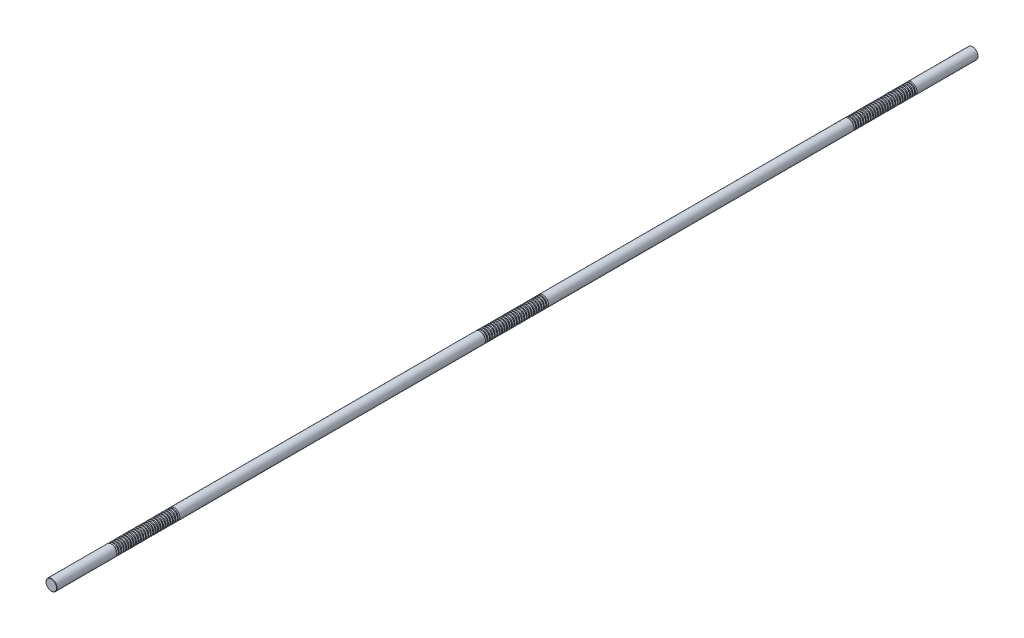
from build123d import *

# Parameters (mm, degrees)
SKETCH1_R           = 9
BOSS_EXTRUDE1_DEPTH = 750
CHAMFER1_SIZE       = 0.45
LPATTERN1_COUNT     = 26
LPATTERN1_PITCH     = 4
LPATTERN2_COUNT     = 3
LPATTERN2_PITCH     = 600


with BuildPart() as part:
    # Sketch1 → Boss-Extrude1 (new, symmetric)
    with BuildSketch(Plane.XY):
        Circle(SKETCH1_R)
    extrude(amount=BOSS_EXTRUDE1_DEPTH, both=True)

    # Chamfer1
    chamfer1_edges = [part.edges().sort_by_distance(p)[0] for p in [
        (-9, 0, -750),
        (-9, 0, 750),
    ]]
    chamfer(chamfer1_edges, length=CHAMFER1_SIZE)

    # Sketch2 → Cut-Revolve1 (revolve, cut)
    with BuildSketch(Plane(origin=(0, 0, 0), x_dir=(0, 0, -1), z_dir=(1, 0, 0)), mode=Mode.PRIVATE) as cut_revolve1_sk:
        Polygon((650.301442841, 9), (647.698557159, 9), (648.301442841, 6.75), (649.698557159, 6.75), align=None)
    cut_revolve1 = revolve(cut_revolve1_sk.sketch.rotate(Axis((0, 0, 750), (0, 0, -1)), 90), axis=Axis((0, 0, 750), (0, 0, -1)), mode=Mode.SUBTRACT)

    # LPattern1: Cut-Revolve1 ×26
    with Locations(*[(0, 0, i * LPATTERN1_PITCH) for i in range(1, LPATTERN1_COUNT)]):
        add(cut_revolve1, mode=Mode.SUBTRACT)

    # LPattern2: Cut-Revolve1 ×3
    with Locations(*[(0, 0, i * LPATTERN2_PITCH) for i in range(1, LPATTERN2_COUNT)]):
        add(cut_revolve1, mode=Mode.SUBTRACT)

    # LPattern2 copy 1 sketch → LPattern2 copy 1 (revolve, cut)
    with BuildSketch(Plane(origin=(0, 0, 604), x_dir=(0, 0, -1), z_dir=(1, 0, 0))):
        Polygon((650.301442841, 9), (647.698557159, 9), (648.301442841, 6.75), (649.698557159, 6.75), align=None)
    revolve(axis=Axis((0, 0, 1354), (0, 0, -1)), mode=Mode.SUBTRACT)

    # LPattern2 copy 2 sketch → LPattern2 copy 2 (revolve, cut)
    with BuildSketch(Plane(origin=(0, 0, 1204), x_dir=(0, 0, -1), z_dir=(1, 0, 0))):
        Polygon((650.301442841, 9), (647.698557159, 9), (648.301442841, 6.75), (649.698557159, 6.75), align=None)
    revolve(axis=Axis((0, 0, 1954), (0, 0, -1)), mode=Mode.SUBTRACT)

    # LPattern2 copy 3 sketch → LPattern2 copy 3 (revolve, cut)
    with BuildSketch(Plane(origin=(0, 0, 608), x_dir=(0, 0, -1), z_dir=(1, 0, 0))):
        Polygon((650.301442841, 9), (647.698557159, 9), (648.301442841, 6.75), (649.698557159, 6.75), align=None)
    revolve(axis=Axis((0, 0, 1358), (0, 0, -1)), mode=Mode.SUBTRACT)

    # LPattern2 copy 4 sketch → LPattern2 copy 4 (revolve, cut)
    with BuildSketch(Plane(origin=(0, 0, 1208), x_dir=(0, 0, -1), z_dir=(1, 0, 0))):
        Polygon((650.301442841, 9), (647.698557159, 9), (648.301442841, 6.75), (649.698557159, 6.75), align=None)
    revolve(axis=Axis((0, 0, 1958), (0, 0, -1)), mode=Mode.SUBTRACT)

    # LPattern2 copy 5 sketch → LPattern2 copy 5 (revolve, cut)
    with BuildSketch(Plane(origin=(0, 0, 612), x_dir=(0, 0, -1), z_dir=(1, 0, 0))):
        Polygon((650.301442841, 9), (647.698557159, 9), (648.301442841, 6.75), (649.698557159, 6.75), align=None)
    revolve(axis=Axis((0, 0, 1362), (0, 0, -1)), mode=Mode.SUBTRACT)

    # LPattern2 copy 6 sketch → LPattern2 copy 6 (revolve, cut)
    with BuildSketch(Plane(origin=(0, 0, 1212), x_dir=(0, 0, -1), z_dir=(1, 0, 0))):
        Polygon((650.301442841, 9), (647.698557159, 9), (648.301442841, 6.75), (649.698557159, 6.75), align=None)
    revolve(axis=Axis((0, 0, 1962), (0, 0, -1)), mode=Mode.SUBTRACT)

    # LPattern2 copy 7 sketch → LPattern2 copy 7 (revolve, cut)
    with BuildSketch(Plane(origin=(0, 0, 616), x_dir=(0, 0, -1), z_dir=(1, 0, 0))):
        Polygon((650.301442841, 9), (647.698557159, 9), (648.301442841, 6.75), (649.698557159, 6.75), align=None)
    revolve(axis=Axis((0, 0, 1366), (0, 0, -1)), mode=Mode.SUBTRACT)

    # LPattern2 copy 8 sketch → LPattern2 copy 8 (revolve, cut)
    with BuildSketch(Plane(origin=(0, 0, 1216), x_dir=(0, 0, -1), z_dir=(1, 0, 0))):
        Polygon((650.301442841, 9), (647.698557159, 9), (648.301442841, 6.75), (649.698557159, 6.75), align=None)
    revolve(axis=Axis((0, 0, 1966), (0, 0, -1)), mode=Mode.SUBTRACT)

    # LPattern2 copy 9 sketch → LPattern2 copy 9 (revolve, cut)
    with BuildSketch(Plane(origin=(0, 0, 620), x_dir=(0, 0, -1), z_dir=(1, 0, 0))):
        Polygon((650.301442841, 9), (647.698557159, 9), (648.301442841, 6.75), (649.698557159, 6.75), align=None)
    revolve(axis=Axis((0, 0, 1370), (0, 0, -1)), mode=Mode.SUBTRACT)

    # LPattern2 copy 10 sketch → LPattern2 copy 10 (revolve, cut)
    with BuildSketch(Plane(origin=(0, 0, 1220), x_dir=(0, 0, -1), z_dir=(1, 0, 0))):
        Polygon((650.301442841, 9), (647.698557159, 9), (648.301442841, 6.75), (649.698557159, 6.75), align=None)
    revolve(axis=Axis((0, 0, 1970), (0, 0, -1)), mode=Mode.SUBTRACT)

    # LPattern2 copy 11 sketch → LPattern2 copy 11 (revolve, cut)
    with BuildSketch(Plane(origin=(0, 0, 624), x_dir=(0, 0, -1), z_dir=(1, 0, 0))):
        Polygon((650.301442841, 9), (647.698557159, 9), (648.301442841, 6.75), (649.698557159, 6.75), align=None)
    revolve(axis=Axis((0, 0, 1374), (0, 0, -1)), mode=Mode.SUBTRACT)

    # LPattern2 copy 12 sketch → LPattern2 copy 12 (revolve, cut)
    with BuildSketch(Plane(origin=(0, 0, 1224), x_dir=(0, 0, -1), z_dir=(1, 0, 0))):
        Polygon((650.301442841, 9), (647.698557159, 9), (648.301442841, 6.75), (649.698557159, 6.75), align=None)
    revolve(axis=Axis((0, 0, 1974), (0, 0, -1)), mode=Mode.SUBTRACT)

    # LPattern2 copy 13 sketch → LPattern2 copy 13 (revolve, cut)
    with BuildSketch(Plane(origin=(0, 0, 628), x_dir=(0, 0, -1), z_dir=(1, 0, 0))):
        Polygon((650.301442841, 9), (647.698557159, 9), (648.301442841, 6.75), (649.698557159, 6.75), align=None)
    revolve(axis=Axis((0, 0, 1378), (0, 0, -1)), mode=Mode.SUBTRACT)

    # LPattern2 copy 14 sketch → LPattern2 copy 14 (revolve, cut)
    with BuildSketch(Plane(origin=(0, 0, 1228), x_dir=(0, 0, -1), z_dir=(1, 0, 0))):
        Polygon((650.301442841, 9), (647.698557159, 9), (648.301442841, 6.75), (649.698557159, 6.75), align=None)
    revolve(axis=Axis((0, 0, 1978), (0, 0, -1)), mode=Mode.SUBTRACT)

    # LPattern2 copy 15 sketch → LPattern2 copy 15 (revolve, cut)
    with BuildSketch(Plane(origin=(0, 0, 632), x_dir=(0, 0, -1), z_dir=(1, 0, 0))):
        Polygon((650.301442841, 9), (647.698557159, 9), (648.301442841, 6.75), (649.698557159, 6.75), align=None)
    revolve(axis=Axis((0, 0, 1382), (0, 0, -1)), mode=Mode.SUBTRACT)

    # LPattern2 copy 16 sketch → LPattern2 copy 16 (revolve, cut)
    with BuildSketch(Plane(origin=(0, 0, 1232), x_dir=(0, 0, -1), z_dir=(1, 0, 0))):
        Polygon((650.301442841, 9), (647.698557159, 9), (648.301442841, 6.75), (649.698557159, 6.75), align=None)
    revolve(axis=Axis((0, 0, 1982), (0, 0, -1)), mode=Mode.SUBTRACT)

    # LPattern2 copy 17 sketch → LPattern2 copy 17 (revolve, cut)
    with BuildSketch(Plane(origin=(0, 0, 636), x_dir=(0, 0, -1), z_dir=(1, 0, 0))):
        Polygon((650.301442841, 9), (647.698557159, 9), (648.301442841, 6.75), (649.698557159, 6.75), align=None)
    revolve(axis=Axis((0, 0, 1386), (0, 0, -1)), mode=Mode.SUBTRACT)

    # LPattern2 copy 18 sketch → LPattern2 copy 18 (revolve, cut)
    with BuildSketch(Plane(origin=(0, 0, 1236), x_dir=(0, 0, -1), z_dir=(1, 0, 0))):
        Polygon((650.301442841, 9), (647.698557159, 9), (648.301442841, 6.75), (649.698557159, 6.75), align=None)
    revolve(axis=Axis((0, 0, 1986), (0, 0, -1)), mode=Mode.SUBTRACT)

    # LPattern2 copy 19 sketch → LPattern2 copy 19 (revolve, cut)
    with BuildSketch(Plane(origin=(0, 0, 640), x_dir=(0, 0, -1), z_dir=(1, 0, 0))):
        Polygon((650.301442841, 9), (647.698557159, 9), (648.301442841, 6.75), (649.698557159, 6.75), align=None)
    revolve(axis=Axis((0, 0, 1390), (0, 0, -1)), mode=Mode.SUBTRACT)

    # LPattern2 copy 20 sketch → LPattern2 copy 20 (revolve, cut)
    with BuildSketch(Plane(origin=(0, 0, 1240), x_dir=(0, 0, -1), z_dir=(1, 0, 0))):
        Polygon((650.301442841, 9), (647.698557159, 9), (648.301442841, 6.75), (649.698557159, 6.75), align=None)
    revolve(axis=Axis((0, 0, 1990), (0, 0, -1)), mode=Mode.SUBTRACT)

    # LPattern2 copy 21 sketch → LPattern2 copy 21 (revolve, cut)
    with BuildSketch(Plane(origin=(0, 0, 644), x_dir=(0, 0, -1), z_dir=(1, 0, 0))):
        Polygon((650.301442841, 9), (647.698557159, 9), (648.301442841, 6.75), (649.698557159, 6.75), align=None)
    revolve(axis=Axis((0, 0, 1394), (0, 0, -1)), mode=Mode.SUBTRACT)

    # LPattern2 copy 22 sketch → LPattern2 copy 22 (revolve, cut)
    with BuildSketch(Plane(origin=(0, 0, 1244), x_dir=(0, 0, -1), z_dir=(1, 0, 0))):
        Polygon((650.301442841, 9), (647.698557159, 9), (648.301442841, 6.75), (649.698557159, 6.75), align=None)
    revolve(axis=Axis((0, 0, 1994), (0, 0, -1)), mode=Mode.SUBTRACT)

    # LPattern2 copy 23 sketch → LPattern2 copy 23 (revolve, cut)
    with BuildSketch(Plane(origin=(0, 0, 648), x_dir=(0, 0, -1), z_dir=(1, 0, 0))):
        Polygon((650.301442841, 9), (647.698557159, 9), (648.301442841, 6.75), (649.698557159, 6.75), align=None)
    revolve(axis=Axis((0, 0, 1398), (0, 0, -1)), mode=Mode.SUBTRACT)

    # LPattern2 copy 24 sketch → LPattern2 copy 24 (revolve, cut)
    with BuildSketch(Plane(origin=(0, 0, 1248), x_dir=(0, 0, -1), z_dir=(1, 0, 0))):
        Polygon((650.301442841, 9), (647.698557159, 9), (648.301442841, 6.75), (649.698557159, 6.75), align=None)
    revolve(axis=Axis((0, 0, 1998), (0, 0, -1)), mode=Mode.SUBTRACT)

    # LPattern2 copy 25 sketch → LPattern2 copy 25 (revolve, cut)
    with BuildSketch(Plane(origin=(0, 0, 652), x_dir=(0, 0, -1), z_dir=(1, 0, 0))):
        Polygon((650.301442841, 9), (647.698557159, 9), (648.301442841, 6.75), (649.698557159, 6.75), align=None)
    revolve(axis=Axis((0, 0, 1402), (0, 0, -1)), mode=Mode.SUBTRACT)

    # LPattern2 copy 26 sketch → LPattern2 copy 26 (revolve, cut)
    with BuildSketch(Plane(origin=(0, 0, 1252), x_dir=(0, 0, -1), z_dir=(1, 0, 0))):
        Polygon((650.301442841, 9), (647.698557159, 9), (648.301442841, 6.75), (649.698557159, 6.75), align=None)
    revolve(axis=Axis((0, 0, 2002), (0, 0, -1)), mode=Mode.SUBTRACT)

    # LPattern2 copy 27 sketch → LPattern2 copy 27 (revolve, cut)
    with BuildSketch(Plane(origin=(0, 0, 656), x_dir=(0, 0, -1), z_dir=(1, 0, 0))):
        Polygon((650.301442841, 9), (647.698557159, 9), (648.301442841, 6.75), (649.698557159, 6.75), align=None)
    revolve(axis=Axis((0, 0, 1406), (0, 0, -1)), mode=Mode.SUBTRACT)

    # LPattern2 copy 28 sketch → LPattern2 copy 28 (revolve, cut)
    with BuildSketch(Plane(origin=(0, 0, 1256), x_dir=(0, 0, -1), z_dir=(1, 0, 0))):
        Polygon((650.301442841, 9), (647.698557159, 9), (648.301442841, 6.75), (649.698557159, 6.75), align=None)
    revolve(axis=Axis((0, 0, 2006), (0, 0, -1)), mode=Mode.SUBTRACT)

    # LPattern2 copy 29 sketch → LPattern2 copy 29 (revolve, cut)
    with BuildSketch(Plane(origin=(0, 0, 660), x_dir=(0, 0, -1), z_dir=(1, 0, 0))):
        Polygon((650.301442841, 9), (647.698557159, 9), (648.301442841, 6.75), (649.698557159, 6.75), align=None)
    revolve(axis=Axis((0, 0, 1410), (0, 0, -1)), mode=Mode.SUBTRACT)

    # LPattern2 copy 30 sketch → LPattern2 copy 30 (revolve, cut)
    with BuildSketch(Plane(origin=(0, 0, 1260), x_dir=(0, 0, -1), z_dir=(1, 0, 0))):
        Polygon((650.301442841, 9), (647.698557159, 9), (648.301442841, 6.75), (649.698557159, 6.75), align=None)
    revolve(axis=Axis((0, 0, 2010), (0, 0, -1)), mode=Mode.SUBTRACT)

    # LPattern2 copy 31 sketch → LPattern2 copy 31 (revolve, cut)
    with BuildSketch(Plane(origin=(0, 0, 664), x_dir=(0, 0, -1), z_dir=(1, 0, 0))):
        Polygon((650.301442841, 9), (647.698557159, 9), (648.301442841, 6.75), (649.698557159, 6.75), align=None)
    revolve(axis=Axis((0, 0, 1414), (0, 0, -1)), mode=Mode.SUBTRACT)

    # LPattern2 copy 32 sketch → LPattern2 copy 32 (revolve, cut)
    with BuildSketch(Plane(origin=(0, 0, 1264), x_dir=(0, 0, -1), z_dir=(1, 0, 0))):
        Polygon((650.301442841, 9), (647.698557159, 9), (648.301442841, 6.75), (649.698557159, 6.75), align=None)
    revolve(axis=Axis((0, 0, 2014), (0, 0, -1)), mode=Mode.SUBTRACT)

    # LPattern2 copy 33 sketch → LPattern2 copy 33 (revolve, cut)
    with BuildSketch(Plane(origin=(0, 0, 668), x_dir=(0, 0, -1), z_dir=(1, 0, 0))):
        Polygon((650.301442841, 9), (647.698557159, 9), (648.301442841, 6.75), (649.698557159, 6.75), align=None)
    revolve(axis=Axis((0, 0, 1418), (0, 0, -1)), mode=Mode.SUBTRACT)

    # LPattern2 copy 34 sketch → LPattern2 copy 34 (revolve, cut)
    with BuildSketch(Plane(origin=(0, 0, 1268), x_dir=(0, 0, -1), z_dir=(1, 0, 0))):
        Polygon((650.301442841, 9), (647.698557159, 9), (648.301442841, 6.75), (649.698557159, 6.75), align=None)
    revolve(axis=Axis((0, 0, 2018), (0, 0, -1)), mode=Mode.SUBTRACT)

    # LPattern2 copy 35 sketch → LPattern2 copy 35 (revolve, cut)
    with BuildSketch(Plane(origin=(0, 0, 672), x_dir=(0, 0, -1), z_dir=(1, 0, 0))):
        Polygon((650.301442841, 9), (647.698557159, 9), (648.301442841, 6.75), (649.698557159, 6.75), align=None)
    revolve(axis=Axis((0, 0, 1422), (0, 0, -1)), mode=Mode.SUBTRACT)

    # LPattern2 copy 36 sketch → LPattern2 copy 36 (revolve, cut)
    with BuildSketch(Plane(origin=(0, 0, 1272), x_dir=(0, 0, -1), z_dir=(1, 0, 0))):
        Polygon((650.301442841, 9), (647.698557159, 9), (648.301442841, 6.75), (649.698557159, 6.75), align=None)
    revolve(axis=Axis((0, 0, 2022), (0, 0, -1)), mode=Mode.SUBTRACT)

    # LPattern2 copy 37 sketch → LPattern2 copy 37 (revolve, cut)
    with BuildSketch(Plane(origin=(0, 0, 676), x_dir=(0, 0, -1), z_dir=(1, 0, 0))):
        Polygon((650.301442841, 9), (647.698557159, 9), (648.301442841, 6.75), (649.698557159, 6.75), align=None)
    revolve(axis=Axis((0, 0, 1426), (0, 0, -1)), mode=Mode.SUBTRACT)

    # LPattern2 copy 38 sketch → LPattern2 copy 38 (revolve, cut)
    with BuildSketch(Plane(origin=(0, 0, 1276), x_dir=(0, 0, -1), z_dir=(1, 0, 0))):
        Polygon((650.301442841, 9), (647.698557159, 9), (648.301442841, 6.75), (649.698557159, 6.75), align=None)
    revolve(axis=Axis((0, 0, 2026), (0, 0, -1)), mode=Mode.SUBTRACT)

    # LPattern2 copy 39 sketch → LPattern2 copy 39 (revolve, cut)
    with BuildSketch(Plane(origin=(0, 0, 680), x_dir=(0, 0, -1), z_dir=(1, 0, 0))):
        Polygon((650.301442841, 9), (647.698557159, 9), (648.301442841, 6.75), (649.698557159, 6.75), align=None)
    revolve(axis=Axis((0, 0, 1430), (0, 0, -1)), mode=Mode.SUBTRACT)

    # LPattern2 copy 40 sketch → LPattern2 copy 40 (revolve, cut)
    with BuildSketch(Plane(origin=(0, 0, 1280), x_dir=(0, 0, -1), z_dir=(1, 0, 0))):
        Polygon((650.301442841, 9), (647.698557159, 9), (648.301442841, 6.75), (649.698557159, 6.75), align=None)
    revolve(axis=Axis((0, 0, 2030), (0, 0, -1)), mode=Mode.SUBTRACT)

    # LPattern2 copy 41 sketch → LPattern2 copy 41 (revolve, cut)
    with BuildSketch(Plane(origin=(0, 0, 684), x_dir=(0, 0, -1), z_dir=(1, 0, 0))):
        Polygon((650.301442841, 9), (647.698557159, 9), (648.301442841, 6.75), (649.698557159, 6.75), align=None)
    revolve(axis=Axis((0, 0, 1434), (0, 0, -1)), mode=Mode.SUBTRACT)

    # LPattern2 copy 42 sketch → LPattern2 copy 42 (revolve, cut)
    with BuildSketch(Plane(origin=(0, 0, 1284), x_dir=(0, 0, -1), z_dir=(1, 0, 0))):
        Polygon((650.301442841, 9), (647.698557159, 9), (648.301442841, 6.75), (649.698557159, 6.75), align=None)
    revolve(axis=Axis((0, 0, 2034), (0, 0, -1)), mode=Mode.SUBTRACT)

    # LPattern2 copy 43 sketch → LPattern2 copy 43 (revolve, cut)
    with BuildSketch(Plane(origin=(0, 0, 688), x_dir=(0, 0, -1), z_dir=(1, 0, 0))):
        Polygon((650.301442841, 9), (647.698557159, 9), (648.301442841, 6.75), (649.698557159, 6.75), align=None)
    revolve(axis=Axis((0, 0, 1438), (0, 0, -1)), mode=Mode.SUBTRACT)

    # LPattern2 copy 44 sketch → LPattern2 copy 44 (revolve, cut)
    with BuildSketch(Plane(origin=(0, 0, 1288), x_dir=(0, 0, -1), z_dir=(1, 0, 0))):
        Polygon((650.301442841, 9), (647.698557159, 9), (648.301442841, 6.75), (649.698557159, 6.75), align=None)
    revolve(axis=Axis((0, 0, 2038), (0, 0, -1)), mode=Mode.SUBTRACT)

    # LPattern2 copy 45 sketch → LPattern2 copy 45 (revolve, cut)
    with BuildSketch(Plane(origin=(0, 0, 692), x_dir=(0, 0, -1), z_dir=(1, 0, 0))):
        Polygon((650.301442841, 9), (647.698557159, 9), (648.301442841, 6.75), (649.698557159, 6.75), align=None)
    revolve(axis=Axis((0, 0, 1442), (0, 0, -1)), mode=Mode.SUBTRACT)

    # LPattern2 copy 46 sketch → LPattern2 copy 46 (revolve, cut)
    with BuildSketch(Plane(origin=(0, 0, 1292), x_dir=(0, 0, -1), z_dir=(1, 0, 0))):
        Polygon((650.301442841, 9), (647.698557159, 9), (648.301442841, 6.75), (649.698557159, 6.75), align=None)
    revolve(axis=Axis((0, 0, 2042), (0, 0, -1)), mode=Mode.SUBTRACT)

    # LPattern2 copy 47 sketch → LPattern2 copy 47 (revolve, cut)
    with BuildSketch(Plane(origin=(0, 0, 696), x_dir=(0, 0, -1), z_dir=(1, 0, 0))):
        Polygon((650.301442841, 9), (647.698557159, 9), (648.301442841, 6.75), (649.698557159, 6.75), align=None)
    revolve(axis=Axis((0, 0, 1446), (0, 0, -1)), mode=Mode.SUBTRACT)

    # LPattern2 copy 48 sketch → LPattern2 copy 48 (revolve, cut)
    with BuildSketch(Plane(origin=(0, 0, 1296), x_dir=(0, 0, -1), z_dir=(1, 0, 0))):
        Polygon((650.301442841, 9), (647.698557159, 9), (648.301442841, 6.75), (649.698557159, 6.75), align=None)
    revolve(axis=Axis((0, 0, 2046), (0, 0, -1)), mode=Mode.SUBTRACT)

    # LPattern2 copy 49 sketch → LPattern2 copy 49 (revolve, cut)
    with BuildSketch(Plane(origin=(0, 0, 700), x_dir=(0, 0, -1), z_dir=(1, 0, 0))):
        Polygon((650.301442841, 9), (647.698557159, 9), (648.301442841, 6.75), (649.698557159, 6.75), align=None)
    revolve(axis=Axis((0, 0, 1450), (0, 0, -1)), mode=Mode.SUBTRACT)

    # LPattern2 copy 50 sketch → LPattern2 copy 50 (revolve, cut)
    with BuildSketch(Plane(origin=(0, 0, 1300), x_dir=(0, 0, -1), z_dir=(1, 0, 0))):
        Polygon((650.301442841, 9), (647.698557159, 9), (648.301442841, 6.75), (649.698557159, 6.75), align=None)
    revolve(axis=Axis((0, 0, 2050), (0, 0, -1)), mode=Mode.SUBTRACT)


solid = part.part
